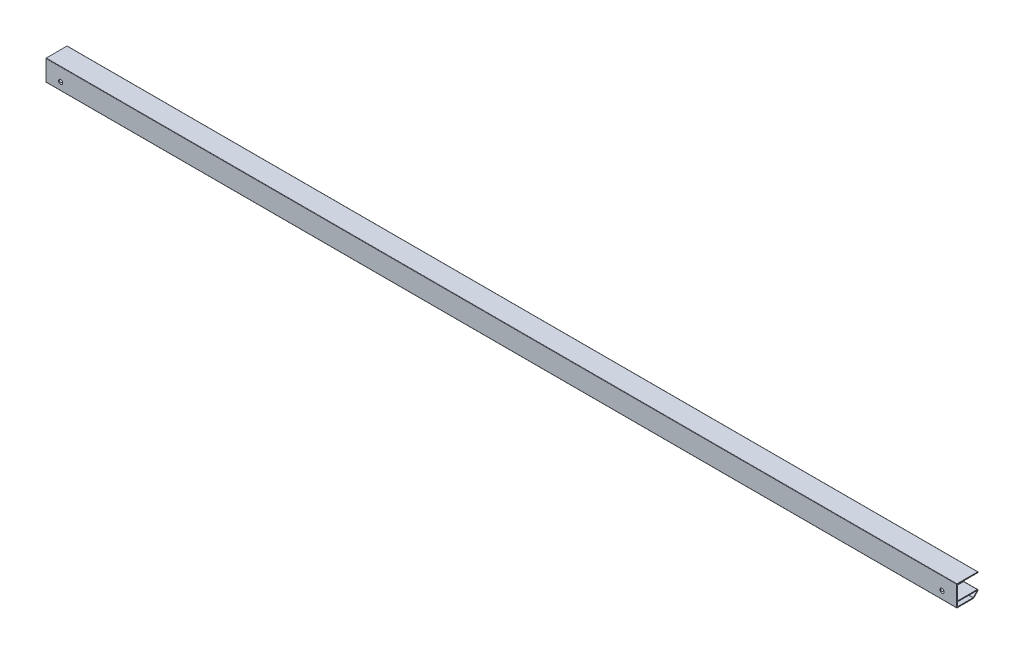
from build123d import *

# Parameters (mm, degrees)
BOSS_EXTRU_1_DEPTH      = 1087
ESQUISSE2_R             = 2.5
ENL_V_MAT_EXTRU_1_DEPTH = 1088.5840933


with BuildPart() as part:
    # Esquisse1 → Boss.-Extru.1 (new body)
    with BuildSketch(Plane(origin=(0, 0, 0), x_dir=(0, 0, -1), z_dir=(1, 0, 0))):
        with BuildLine():
            Line((0, 24.6), (0, 0.4))
            ThreePointArc((0, 0.4), (0.117157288, 0.117157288), (0.4, 0))
            Line((0.4, 0), (19.585786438, 0))
            ThreePointArc((19.585786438, 0), (19.96846987, 0.076120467), (20.292893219, 0.292893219))
            Line((20.292893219, 0.292893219), (25.107106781, 5.107106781))
            ThreePointArc((25.107106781, 5.107106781), (25.323879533, 5.43153013), (25.4, 5.814213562))
            Line((25.4, 5.814213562), (25.4, 6))
            ThreePointArc((25.4, 6), (25.107106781, 6.707106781), (24.4, 7))
            Line((24.4, 7), (1.25, 7))
            ThreePointArc((1.25, 7), (1.073223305, 7.073223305), (1, 7.25))
            Line((1, 7.25), (1, 23.75))
            ThreePointArc((1, 23.75), (1.073223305, 23.926776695), (1.25, 24))
            Line((1.25, 24), (25, 24))
            ThreePointArc((25, 24), (25.282842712, 24.117157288), (25.4, 24.4))
            Line((25.4, 24.4), (25.4, 24.6))
            ThreePointArc((25.4, 24.6), (25.282842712, 24.882842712), (25, 25))
            Line((25, 25), (0.4, 25))
            ThreePointArc((0.4, 25), (0.117157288, 24.882842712), (0, 24.6))
        make_face()
        with BuildLine():
            Line((1, 5.75), (1, 1.25))
            ThreePointArc((1, 1.25), (1.073223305, 1.073223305), (1.25, 1))
            Line((1.25, 1), (19.420101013, 1))
            ThreePointArc((19.420101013, 1), (19.573174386, 1.030448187), (19.702943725, 1.117157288))
            Line((19.702943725, 1.117157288), (24.071516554, 5.485730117))
            ThreePointArc((24.071516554, 5.485730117), (24.136819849, 5.81403195), (23.858498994, 6))
            Line((23.858498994, 6), (1.25, 6))
            ThreePointArc((1.25, 6), (1.073223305, 5.926776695), (1, 5.75))
        make_face(mode=Mode.SUBTRACT)
    extrude(amount=BOSS_EXTRU_1_DEPTH)

    # Esquisse2 → Enl_v. mat.-Extru.1 (cut, through all)
    with BuildSketch(Plane.XY):
        with Locations((17.5, 9.2)):
            Circle(ESQUISSE2_R)
        with Locations(Location((1069.5, 9.2, 0), (0, 0, 308.739424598))):
            Circle(ESQUISSE2_R)
    extrude(amount=-ENL_V_MAT_EXTRU_1_DEPTH, mode=Mode.SUBTRACT)


solid = part.part
